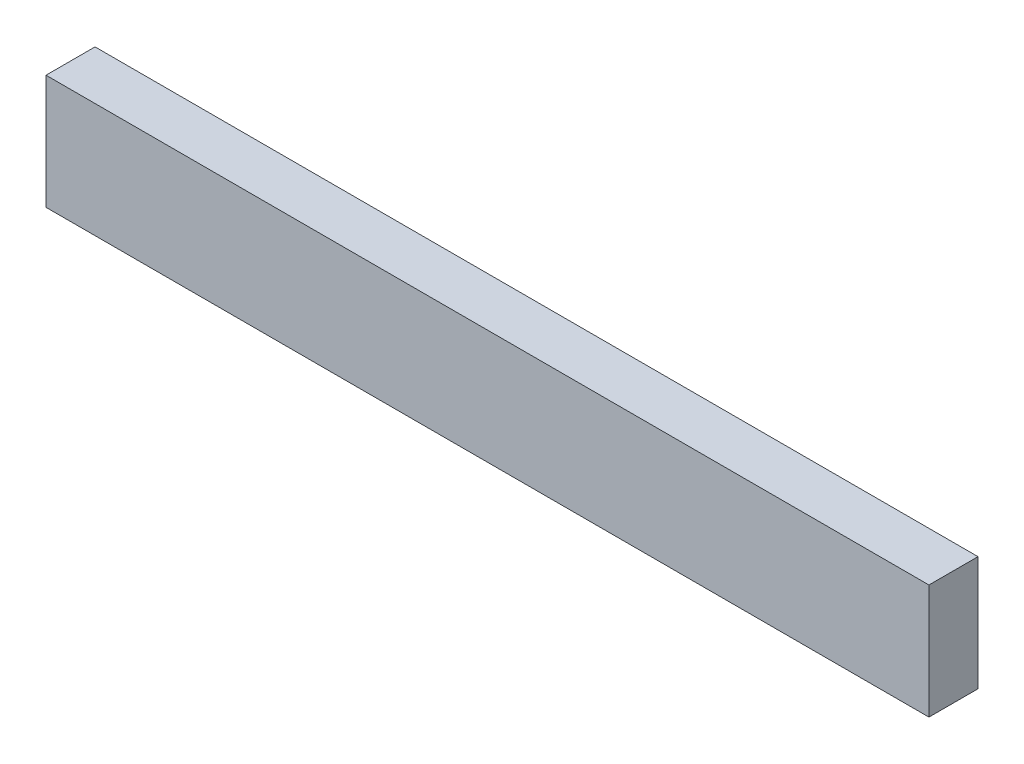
from build123d import *

# Parameters (mm, degrees)
SKETCH1_W           = 38.1
SKETCH1_H           = 88.9
BOSS_EXTRUDE1_DEPTH = 685.8


with BuildPart() as part:
    # Sketch1 → Boss-Extrude1 (new body)
    with BuildSketch(Plane(origin=(0, 0, 0), x_dir=(0, 0, -1), z_dir=(1, 0, 0))):
        Rectangle(SKETCH1_W, SKETCH1_H)
    extrude(amount=BOSS_EXTRUDE1_DEPTH)


solid = part.part
